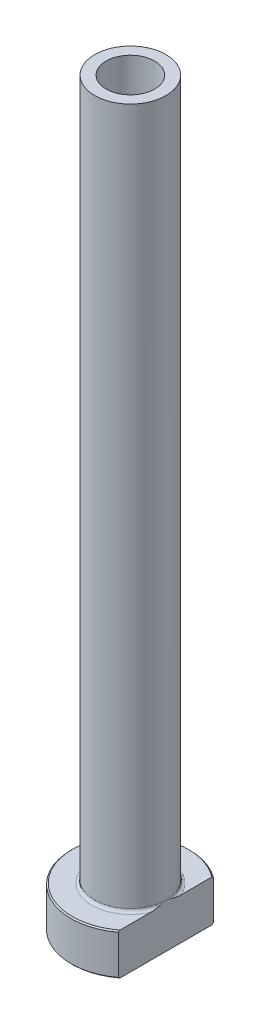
from build123d import *

# Parameters (mm, degrees)
FILLET1_R          = 0.5
CHAMFER1_SIZE      = 0.2
CUT_EXTRUDE1_DEPTH = 126.797456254
CHAMFER2_SIZE      = 0.5


with BuildPart() as part:
    # Sketch1 → Revolve1 (revolve)
    with BuildSketch(Plane.XY, mode=Mode.PRIVATE) as revolve1_sk:
        Polygon((-4.1, 125), (-6, 125), (-6, 7), (-10, 7), (-10, 0), (-4.35, 0), (-4.35, 68), (-4.1, 80), align=None)
    revolve(revolve1_sk.sketch.rotate(Axis((0, 92.187680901, 0), (0, -1, 0)), 270), axis=Axis((0, 92.187680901, 0), (0, -1, 0)))

    # Fillet1
    fillet1_edges = [part.edges().sort_by_distance(p)[0] for p in [
        (0, 7, -6),
    ]]
    fillet(fillet1_edges, radius=FILLET1_R)

    # Chamfer1
    chamfer1_edges = [part.edges().sort_by_distance(p)[0] for p in [
        (0, 0, -10),
        (0, 7, -10),
    ]]
    chamfer(chamfer1_edges, length=CHAMFER1_SIZE)

    # Sketch2 → Cut-Extrude1 (cut, through all)
    with BuildSketch(Plane.XZ):
        with BuildLine():
            Line((6, 8), (6, -8))
            ThreePointArc((6, -8), (10, 0), (6, 8))
        make_face()
    extrude(amount=-CUT_EXTRUDE1_DEPTH, mode=Mode.SUBTRACT)

    # Chamfer2
    chamfer2_edges = [part.edges().sort_by_distance(p)[0] for p in [
        (0, 0, -4.35),
    ]]
    chamfer(chamfer2_edges, length=CHAMFER2_SIZE)


solid = part.part
